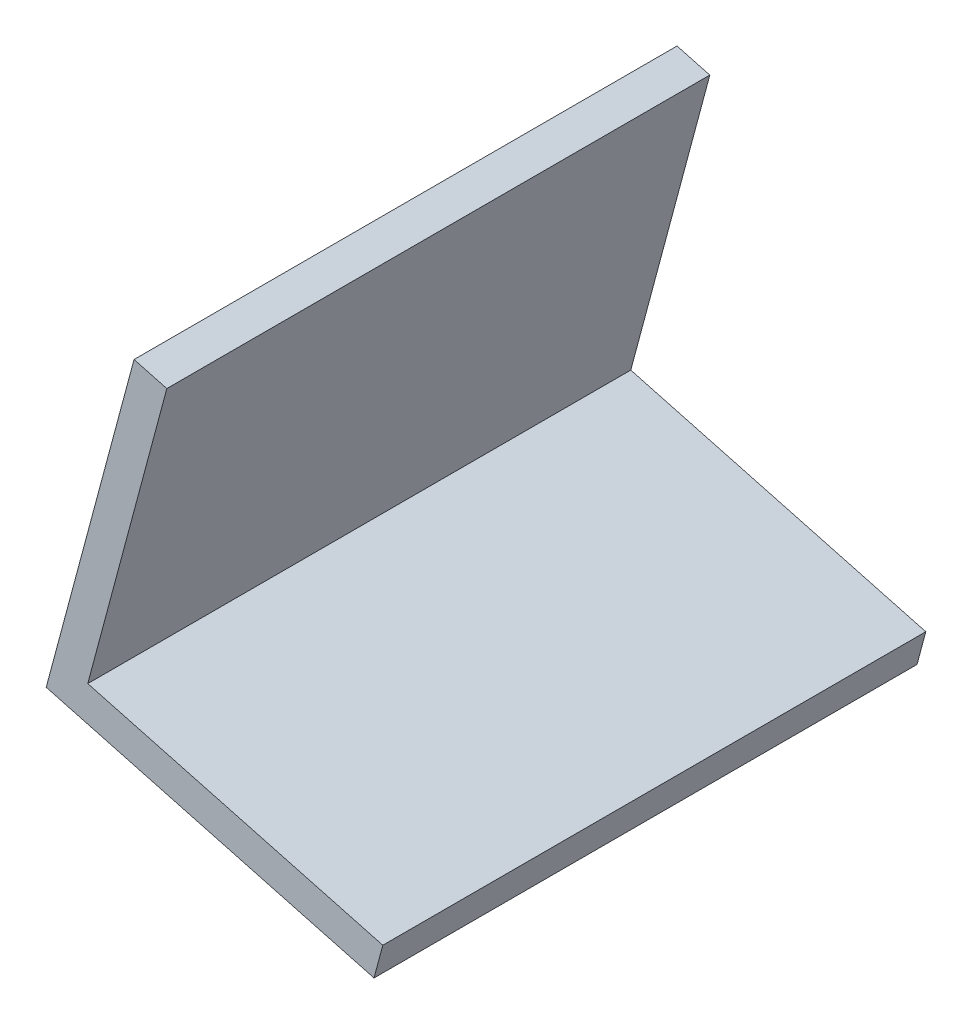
from build123d import *

# Parameters (mm, degrees)
BASE_EXTRUSION_DEPTH = 80


with BuildPart() as part:
    # Esquisse1 → Base-Extrusion (new body)
    with BuildSketch(Plane.XY):
        Polygon((2512.821924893, 3834.702897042), (2517.651554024, 3833.408801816), (2506.004696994, 3789.942139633), (2549.471359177, 3778.295282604), (2548.177263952, 3773.465653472), (2499.880972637, 3786.406605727), align=None)
    extrude(amount=-BASE_EXTRUSION_DEPTH)


solid = part.part
